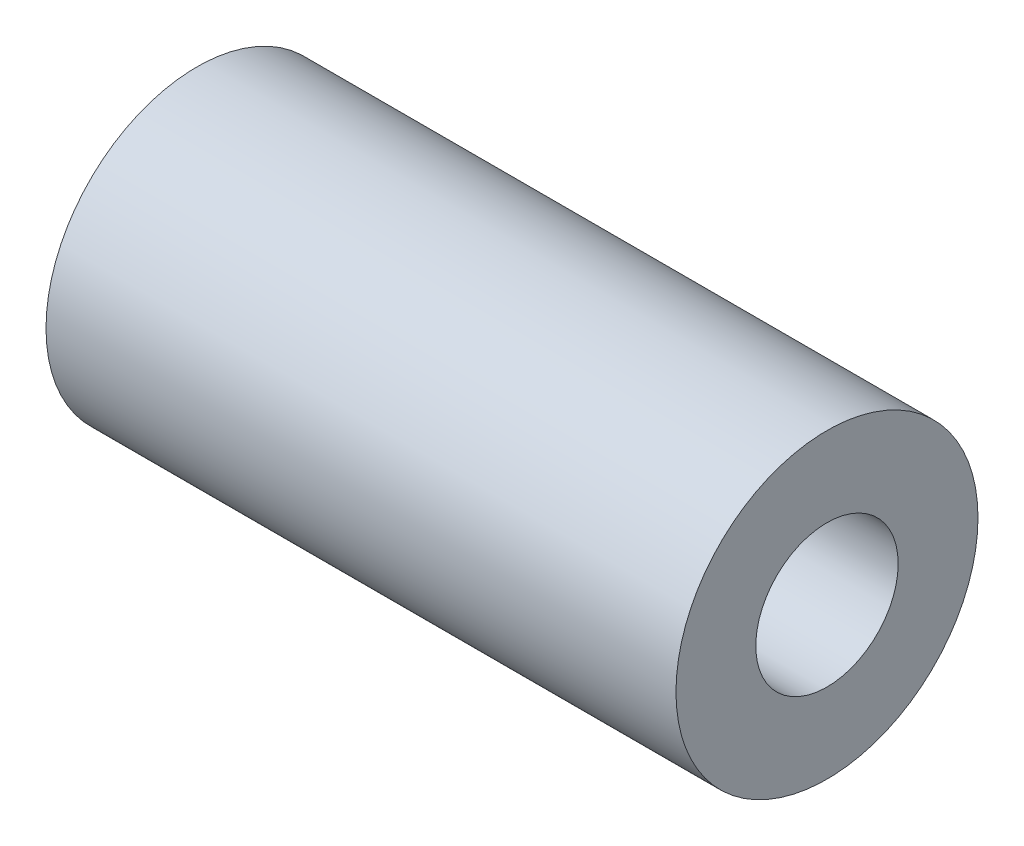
from build123d import *

# Parameters (mm, degrees)
SKETCH1_R           = 3.5
SKETCH1_R_2         = 1.65
BOSS_EXTRUDE1_DEPTH = 14.6


with BuildPart() as part:
    # Sketch1 → Boss-Extrude1 (new body)
    with BuildSketch(Plane(origin=(0, 0, 0), x_dir=(0, 0, -1), z_dir=(1, 0, 0))):
        Circle(SKETCH1_R)
        Circle(SKETCH1_R_2, mode=Mode.SUBTRACT)
    extrude(amount=BOSS_EXTRUDE1_DEPTH)


solid = part.part
